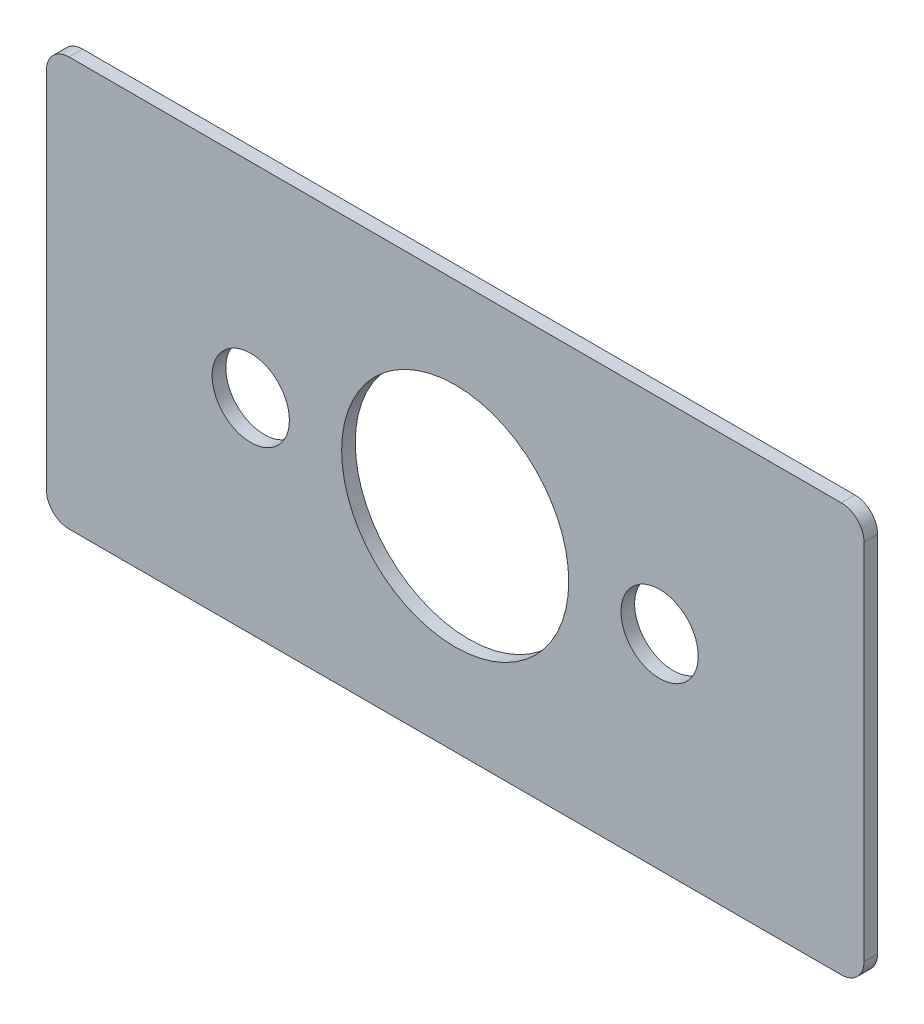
ISO-10303-21;
HEADER;
FILE_DESCRIPTION(('STEP AP214'),'2;1');
FILE_NAME('part.step','',(''),(''),'','','');
FILE_SCHEMA(('AUTOMOTIVE_DESIGN { 1 0 10303 214 1 1 1 1 }'));
ENDSEC;
DATA;
#1=APPLICATION_CONTEXT('core data for automotive mechanical design processes');
#2=APPLICATION_PROTOCOL_DEFINITION('international standard','automotive_design',2000,#1);
#3=PRODUCT_CONTEXT('',#1,'mechanical');
#4=PRODUCT('Part','Part','',(#3));
#5=PRODUCT_RELATED_PRODUCT_CATEGORY('part','',(#4));
#6=PRODUCT_DEFINITION_FORMATION('','',#4);
#7=PRODUCT_DEFINITION_CONTEXT('part definition',#1,'design');
#8=PRODUCT_DEFINITION('design','',#6,#7);
#9=PRODUCT_DEFINITION_SHAPE('','',#8);
#10=(LENGTH_UNIT() NAMED_UNIT(*) SI_UNIT(.MILLI.,.METRE.));
#11=(NAMED_UNIT(*) PLANE_ANGLE_UNIT() SI_UNIT($,.RADIAN.));
#12=(NAMED_UNIT(*) SI_UNIT($,.STERADIAN.) SOLID_ANGLE_UNIT());
#13=UNCERTAINTY_MEASURE_WITH_UNIT(LENGTH_MEASURE(1.E-05),#10,'distance_accuracy_value','');
#14=(GEOMETRIC_REPRESENTATION_CONTEXT(3) GLOBAL_UNCERTAINTY_ASSIGNED_CONTEXT((#13)) GLOBAL_UNIT_ASSIGNED_CONTEXT((#10,
#11,#12)) REPRESENTATION_CONTEXT('',''));
#15=CARTESIAN_POINT('',(0.,0.,0.));
#16=DIRECTION('',(0.,0.,1.));
#17=DIRECTION('',(1.,0.,0.));
#18=AXIS2_PLACEMENT_3D('',#15,#16,#17);
#19=CARTESIAN_POINT('',(0.,0.,0.));
#20=DIRECTION('',(0.,0.,1.));
#21=DIRECTION('',(1.,0.,0.));
#22=AXIS2_PLACEMENT_3D('',#19,#20,#21);
#23=PLANE('',#22);
#24=CARTESIAN_POINT('',(22.5,0.,0.));
#25=DIRECTION('',(0.,0.,1.));
#26=DIRECTION('',(1.,0.,0.));
#27=AXIS2_PLACEMENT_3D('',#24,#25,#26);
#28=CIRCLE('',#27,4.25);
#29=CARTESIAN_POINT('',(26.75,0.,0.));
#30=VERTEX_POINT('',#29);
#31=EDGE_CURVE('E136',#30,#30,#28,.T.);
#32=ORIENTED_EDGE('',*,*,#31,.T.);
#33=EDGE_LOOP('',(#32));
#34=FACE_BOUND('',#33,.T.);
#35=CARTESIAN_POINT('',(-22.5,0.,0.));
#36=DIRECTION('',(0.,0.,1.));
#37=DIRECTION('',(1.,0.,0.));
#38=AXIS2_PLACEMENT_3D('',#35,#36,#37);
#39=CIRCLE('',#38,4.25);
#40=CARTESIAN_POINT('',(-18.25,0.,0.));
#41=VERTEX_POINT('',#40);
#42=EDGE_CURVE('E101',#41,#41,#39,.T.);
#43=ORIENTED_EDGE('',*,*,#42,.T.);
#44=EDGE_LOOP('',(#43));
#45=FACE_BOUND('',#44,.T.);
#46=CARTESIAN_POINT('',(0.,0.,0.));
#47=DIRECTION('',(0.,0.,1.));
#48=DIRECTION('',(1.,0.,0.));
#49=AXIS2_PLACEMENT_3D('',#46,#47,#48);
#50=CIRCLE('',#49,12.5);
#51=CARTESIAN_POINT('',(12.5,0.,0.));
#52=VERTEX_POINT('',#51);
#53=EDGE_CURVE('E98',#52,#52,#50,.T.);
#54=ORIENTED_EDGE('',*,*,#53,.T.);
#55=EDGE_LOOP('',(#54));
#56=FACE_BOUND('',#55,.T.);
#57=DIRECTION('',(0.,1.,0.));
#58=VECTOR('',#57,1.);
#59=CARTESIAN_POINT('',(-45.,-22.5,0.));
#60=LINE('',#59,#58);
#61=CARTESIAN_POINT('',(-45.,20.,0.));
#62=VERTEX_POINT('',#61);
#63=CARTESIAN_POINT('',(-45.,-20.,0.));
#64=VERTEX_POINT('',#63);
#65=EDGE_CURVE('E82',#62,#64,#60,.F.);
#66=ORIENTED_EDGE('',*,*,#65,.F.);
#67=CARTESIAN_POINT('',(-42.4999999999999,20.,0.));
#68=DIRECTION('',(0.,0.,1.));
#69=DIRECTION('',(1.,0.,0.));
#70=AXIS2_PLACEMENT_3D('',#67,#68,#69);
#71=CIRCLE('',#70,2.5);
#72=CARTESIAN_POINT('',(-42.4999999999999,22.5,0.));
#73=VERTEX_POINT('',#72);
#74=EDGE_CURVE('E95',#73,#62,#71,.T.);
#75=ORIENTED_EDGE('',*,*,#74,.F.);
#76=DIRECTION('',(1.,0.,0.));
#77=VECTOR('',#76,1.);
#78=CARTESIAN_POINT('',(-44.9999999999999,22.5,0.));
#79=LINE('',#78,#77);
#80=CARTESIAN_POINT('',(42.5,22.5,0.));
#81=VERTEX_POINT('',#80);
#82=EDGE_CURVE('E107',#81,#73,#79,.F.);
#83=ORIENTED_EDGE('',*,*,#82,.F.);
#84=CARTESIAN_POINT('',(42.5,20.,0.));
#85=DIRECTION('',(0.,0.,1.));
#86=DIRECTION('',(1.,0.,0.));
#87=AXIS2_PLACEMENT_3D('',#84,#85,#86);
#88=CIRCLE('',#87,2.5);
#89=CARTESIAN_POINT('',(45.,20.,0.));
#90=VERTEX_POINT('',#89);
#91=EDGE_CURVE('E142',#90,#81,#88,.T.);
#92=ORIENTED_EDGE('',*,*,#91,.F.);
#93=DIRECTION('',(0.,1.,0.));
#94=VECTOR('',#93,1.);
#95=CARTESIAN_POINT('',(45.,22.5,0.));
#96=LINE('',#95,#94);
#97=CARTESIAN_POINT('',(45.,-20.,0.));
#98=VERTEX_POINT('',#97);
#99=EDGE_CURVE('E111',#98,#90,#96,.T.);
#100=ORIENTED_EDGE('',*,*,#99,.F.);
#101=CARTESIAN_POINT('',(42.4999999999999,-20.,0.));
#102=DIRECTION('',(0.,0.,1.));
#103=DIRECTION('',(1.,0.,0.));
#104=AXIS2_PLACEMENT_3D('',#101,#102,#103);
#105=CIRCLE('',#104,2.5);
#106=CARTESIAN_POINT('',(42.4999999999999,-22.5,0.));
#107=VERTEX_POINT('',#106);
#108=EDGE_CURVE('E143',#107,#98,#105,.T.);
#109=ORIENTED_EDGE('',*,*,#108,.F.);
#110=DIRECTION('',(1.,0.,0.));
#111=VECTOR('',#110,1.);
#112=CARTESIAN_POINT('',(44.9999999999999,-22.5,0.));
#113=LINE('',#112,#111);
#114=CARTESIAN_POINT('',(-42.5,-22.5,0.));
#115=VERTEX_POINT('',#114);
#116=EDGE_CURVE('E84',#115,#107,#113,.T.);
#117=ORIENTED_EDGE('',*,*,#116,.F.);
#118=CARTESIAN_POINT('',(-42.5,-20.,0.));
#119=DIRECTION('',(0.,0.,1.));
#120=DIRECTION('',(1.,0.,0.));
#121=AXIS2_PLACEMENT_3D('',#118,#119,#120);
#122=CIRCLE('',#121,2.5);
#123=EDGE_CURVE('E19',#64,#115,#122,.T.);
#124=ORIENTED_EDGE('',*,*,#123,.F.);
#125=EDGE_LOOP('',(#66,#75,#83,#92,#100,#109,#117,#124));
#126=FACE_BOUND('',#125,.T.);
#127=ADVANCED_FACE('F16',(#34,#45,#56,#126),#23,.F.);
#128=CARTESIAN_POINT('',(-42.5,-20.,0.));
#129=DIRECTION('',(0.,0.,1.));
#130=DIRECTION('',(1.,0.,0.));
#131=AXIS2_PLACEMENT_3D('',#128,#129,#130);
#132=CYLINDRICAL_SURFACE('',#131,2.5);
#133=ORIENTED_EDGE('',*,*,#123,.T.);
#134=DIRECTION('',(0.,0.,-1.));
#135=VECTOR('',#134,1.);
#136=CARTESIAN_POINT('',(-42.5,-22.5,0.));
#137=LINE('',#136,#135);
#138=CARTESIAN_POINT('',(-42.5,-22.5,1.5));
#139=VERTEX_POINT('',#138);
#140=EDGE_CURVE('E87',#139,#115,#137,.T.);
#141=ORIENTED_EDGE('',*,*,#140,.F.);
#142=CARTESIAN_POINT('',(-42.5,-20.,1.5));
#143=DIRECTION('',(0.,0.,1.));
#144=DIRECTION('',(1.,0.,0.));
#145=AXIS2_PLACEMENT_3D('',#142,#143,#144);
#146=CIRCLE('',#145,2.5);
#147=CARTESIAN_POINT('',(-45.,-20.,1.5));
#148=VERTEX_POINT('',#147);
#149=EDGE_CURVE('E92',#148,#139,#146,.T.);
#150=ORIENTED_EDGE('',*,*,#149,.F.);
#151=DIRECTION('',(0.,0.,1.));
#152=VECTOR('',#151,1.);
#153=CARTESIAN_POINT('',(-45.,-20.,0.));
#154=LINE('',#153,#152);
#155=EDGE_CURVE('E89',#64,#148,#154,.T.);
#156=ORIENTED_EDGE('',*,*,#155,.F.);
#157=EDGE_LOOP('',(#133,#141,#150,#156));
#158=FACE_BOUND('',#157,.T.);
#159=ADVANCED_FACE('F90',(#158),#132,.T.);
#160=CARTESIAN_POINT('',(44.9999999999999,-22.5,0.));
#161=DIRECTION('',(0.,-1.,0.));
#162=DIRECTION('',(0.,0.,-1.));
#163=AXIS2_PLACEMENT_3D('',#160,#161,#162);
#164=PLANE('',#163);
#165=DIRECTION('',(0.,0.,1.));
#166=VECTOR('',#165,1.);
#167=CARTESIAN_POINT('',(42.4999999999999,-22.5,0.));
#168=LINE('',#167,#166);
#169=CARTESIAN_POINT('',(42.4999999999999,-22.5,1.5));
#170=VERTEX_POINT('',#169);
#171=EDGE_CURVE('E115',#170,#107,#168,.F.);
#172=ORIENTED_EDGE('',*,*,#171,.F.);
#173=DIRECTION('',(1.,0.,0.));
#174=VECTOR('',#173,1.);
#175=CARTESIAN_POINT('',(0.,-22.5,1.5));
#176=LINE('',#175,#174);
#177=EDGE_CURVE('E134',#139,#170,#176,.T.);
#178=ORIENTED_EDGE('',*,*,#177,.F.);
#179=ORIENTED_EDGE('',*,*,#140,.T.);
#180=ORIENTED_EDGE('',*,*,#116,.T.);
#181=EDGE_LOOP('',(#172,#178,#179,#180));
#182=FACE_BOUND('',#181,.T.);
#183=ADVANCED_FACE('F180',(#182),#164,.T.);
#184=CARTESIAN_POINT('',(42.4999999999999,-20.,0.));
#185=DIRECTION('',(0.,0.,1.));
#186=DIRECTION('',(1.,0.,0.));
#187=AXIS2_PLACEMENT_3D('',#184,#185,#186);
#188=CYLINDRICAL_SURFACE('',#187,2.5);
#189=ORIENTED_EDGE('',*,*,#108,.T.);
#190=DIRECTION('',(0.,0.,-1.));
#191=VECTOR('',#190,1.);
#192=CARTESIAN_POINT('',(45.,-20.,0.));
#193=LINE('',#192,#191);
#194=CARTESIAN_POINT('',(45.,-20.,1.5));
#195=VERTEX_POINT('',#194);
#196=EDGE_CURVE('E114',#195,#98,#193,.T.);
#197=ORIENTED_EDGE('',*,*,#196,.F.);
#198=CARTESIAN_POINT('',(42.4999999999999,-20.,1.5));
#199=DIRECTION('',(0.,0.,1.));
#200=DIRECTION('',(1.,0.,0.));
#201=AXIS2_PLACEMENT_3D('',#198,#199,#200);
#202=CIRCLE('',#201,2.5);
#203=EDGE_CURVE('E131',#170,#195,#202,.T.);
#204=ORIENTED_EDGE('',*,*,#203,.F.);
#205=ORIENTED_EDGE('',*,*,#171,.T.);
#206=EDGE_LOOP('',(#189,#197,#204,#205));
#207=FACE_BOUND('',#206,.T.);
#208=ADVANCED_FACE('F177',(#207),#188,.T.);
#209=CARTESIAN_POINT('',(45.,22.5,0.));
#210=DIRECTION('',(1.,0.,0.));
#211=DIRECTION('',(0.,0.,-1.));
#212=AXIS2_PLACEMENT_3D('',#209,#210,#211);
#213=PLANE('',#212);
#214=ORIENTED_EDGE('',*,*,#196,.T.);
#215=ORIENTED_EDGE('',*,*,#99,.T.);
#216=DIRECTION('',(0.,0.,1.));
#217=VECTOR('',#216,1.);
#218=CARTESIAN_POINT('',(45.,20.,0.));
#219=LINE('',#218,#217);
#220=CARTESIAN_POINT('',(45.,20.,1.5));
#221=VERTEX_POINT('',#220);
#222=EDGE_CURVE('E113',#221,#90,#219,.F.);
#223=ORIENTED_EDGE('',*,*,#222,.F.);
#224=DIRECTION('',(0.,1.,0.));
#225=VECTOR('',#224,1.);
#226=CARTESIAN_POINT('',(44.9999999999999,0.,1.5));
#227=LINE('',#226,#225);
#228=EDGE_CURVE('E130',#195,#221,#227,.T.);
#229=ORIENTED_EDGE('',*,*,#228,.F.);
#230=EDGE_LOOP('',(#214,#215,#223,#229));
#231=FACE_BOUND('',#230,.T.);
#232=ADVANCED_FACE('F176',(#231),#213,.T.);
#233=CARTESIAN_POINT('',(42.5,20.,0.));
#234=DIRECTION('',(0.,0.,1.));
#235=DIRECTION('',(1.,0.,0.));
#236=AXIS2_PLACEMENT_3D('',#233,#234,#235);
#237=CYLINDRICAL_SURFACE('',#236,2.5);
#238=ORIENTED_EDGE('',*,*,#91,.T.);
#239=DIRECTION('',(0.,0.,1.));
#240=VECTOR('',#239,1.);
#241=CARTESIAN_POINT('',(42.5,22.5,0.));
#242=LINE('',#241,#240);
#243=CARTESIAN_POINT('',(42.5,22.5,1.5));
#244=VERTEX_POINT('',#243);
#245=EDGE_CURVE('E110',#244,#81,#242,.F.);
#246=ORIENTED_EDGE('',*,*,#245,.F.);
#247=CARTESIAN_POINT('',(42.5,20.,1.5));
#248=DIRECTION('',(0.,0.,1.));
#249=DIRECTION('',(1.,0.,0.));
#250=AXIS2_PLACEMENT_3D('',#247,#248,#249);
#251=CIRCLE('',#250,2.5);
#252=EDGE_CURVE('E127',#221,#244,#251,.T.);
#253=ORIENTED_EDGE('',*,*,#252,.F.);
#254=ORIENTED_EDGE('',*,*,#222,.T.);
#255=EDGE_LOOP('',(#238,#246,#253,#254));
#256=FACE_BOUND('',#255,.T.);
#257=ADVANCED_FACE('F173',(#256),#237,.T.);
#258=CARTESIAN_POINT('',(-44.9999999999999,22.5,0.));
#259=DIRECTION('',(0.,1.,0.));
#260=DIRECTION('',(0.,0.,1.));
#261=AXIS2_PLACEMENT_3D('',#258,#259,#260);
#262=PLANE('',#261);
#263=ORIENTED_EDGE('',*,*,#245,.T.);
#264=ORIENTED_EDGE('',*,*,#82,.T.);
#265=DIRECTION('',(0.,0.,1.));
#266=VECTOR('',#265,1.);
#267=CARTESIAN_POINT('',(-42.4999999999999,22.5,0.));
#268=LINE('',#267,#266);
#269=CARTESIAN_POINT('',(-42.4999999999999,22.5,1.5));
#270=VERTEX_POINT('',#269);
#271=EDGE_CURVE('E109',#270,#73,#268,.F.);
#272=ORIENTED_EDGE('',*,*,#271,.F.);
#273=DIRECTION('',(1.,0.,0.));
#274=VECTOR('',#273,1.);
#275=CARTESIAN_POINT('',(0.,22.5,1.5));
#276=LINE('',#275,#274);
#277=EDGE_CURVE('E126',#244,#270,#276,.F.);
#278=ORIENTED_EDGE('',*,*,#277,.F.);
#279=EDGE_LOOP('',(#263,#264,#272,#278));
#280=FACE_BOUND('',#279,.T.);
#281=ADVANCED_FACE('F168',(#280),#262,.T.);
#282=CARTESIAN_POINT('',(-42.4999999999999,20.,0.));
#283=DIRECTION('',(0.,0.,1.));
#284=DIRECTION('',(1.,0.,0.));
#285=AXIS2_PLACEMENT_3D('',#282,#283,#284);
#286=CYLINDRICAL_SURFACE('',#285,2.5);
#287=ORIENTED_EDGE('',*,*,#74,.T.);
#288=DIRECTION('',(0.,0.,1.));
#289=VECTOR('',#288,1.);
#290=CARTESIAN_POINT('',(-45.,20.,0.));
#291=LINE('',#290,#289);
#292=CARTESIAN_POINT('',(-45.,20.,1.5));
#293=VERTEX_POINT('',#292);
#294=EDGE_CURVE('E34',#293,#62,#291,.F.);
#295=ORIENTED_EDGE('',*,*,#294,.F.);
#296=CARTESIAN_POINT('',(-42.4999999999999,20.,1.5));
#297=DIRECTION('',(0.,0.,1.));
#298=DIRECTION('',(1.,0.,0.));
#299=AXIS2_PLACEMENT_3D('',#296,#297,#298);
#300=CIRCLE('',#299,2.5);
#301=EDGE_CURVE('E123',#270,#293,#300,.T.);
#302=ORIENTED_EDGE('',*,*,#301,.F.);
#303=ORIENTED_EDGE('',*,*,#271,.T.);
#304=EDGE_LOOP('',(#287,#295,#302,#303));
#305=FACE_BOUND('',#304,.T.);
#306=ADVANCED_FACE('F166',(#305),#286,.T.);
#307=CARTESIAN_POINT('',(-45.,-22.5,0.));
#308=DIRECTION('',(-1.,0.,0.));
#309=DIRECTION('',(0.,0.,1.));
#310=AXIS2_PLACEMENT_3D('',#307,#308,#309);
#311=PLANE('',#310);
#312=ORIENTED_EDGE('',*,*,#294,.T.);
#313=ORIENTED_EDGE('',*,*,#65,.T.);
#314=ORIENTED_EDGE('',*,*,#155,.T.);
#315=DIRECTION('',(0.,1.,0.));
#316=VECTOR('',#315,1.);
#317=CARTESIAN_POINT('',(-44.9999999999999,0.,1.5));
#318=LINE('',#317,#316);
#319=EDGE_CURVE('E122',#293,#148,#318,.F.);
#320=ORIENTED_EDGE('',*,*,#319,.F.);
#321=EDGE_LOOP('',(#312,#313,#314,#320));
#322=FACE_BOUND('',#321,.T.);
#323=ADVANCED_FACE('F97',(#322),#311,.T.);
#324=CARTESIAN_POINT('',(0.,0.,0.));
#325=DIRECTION('',(0.,0.,1.));
#326=DIRECTION('',(1.,0.,0.));
#327=AXIS2_PLACEMENT_3D('',#324,#325,#326);
#328=CYLINDRICAL_SURFACE('',#327,12.5);
#329=ORIENTED_EDGE('',*,*,#53,.F.);
#330=EDGE_LOOP('',(#329));
#331=FACE_BOUND('',#330,.T.);
#332=CARTESIAN_POINT('',(0.,0.,1.5));
#333=DIRECTION('',(0.,0.,1.));
#334=DIRECTION('',(1.,0.,0.));
#335=AXIS2_PLACEMENT_3D('',#332,#333,#334);
#336=CIRCLE('',#335,12.5);
#337=CARTESIAN_POINT('',(12.5,0.,1.5));
#338=VERTEX_POINT('',#337);
#339=EDGE_CURVE('E119',#338,#338,#336,.F.);
#340=ORIENTED_EDGE('',*,*,#339,.F.);
#341=EDGE_LOOP('',(#340));
#342=FACE_BOUND('',#341,.T.);
#343=ADVANCED_FACE('F203',(#331,#342),#328,.F.);
#344=CARTESIAN_POINT('',(-22.5,0.,0.));
#345=DIRECTION('',(0.,0.,1.));
#346=DIRECTION('',(1.,0.,0.));
#347=AXIS2_PLACEMENT_3D('',#344,#345,#346);
#348=CYLINDRICAL_SURFACE('',#347,4.25);
#349=ORIENTED_EDGE('',*,*,#42,.F.);
#350=EDGE_LOOP('',(#349));
#351=FACE_BOUND('',#350,.T.);
#352=CARTESIAN_POINT('',(-22.5,0.,1.5));
#353=DIRECTION('',(0.,0.,1.));
#354=DIRECTION('',(1.,0.,0.));
#355=AXIS2_PLACEMENT_3D('',#352,#353,#354);
#356=CIRCLE('',#355,4.25);
#357=CARTESIAN_POINT('',(-18.25,0.,1.5));
#358=VERTEX_POINT('',#357);
#359=EDGE_CURVE('E25',#358,#358,#356,.F.);
#360=ORIENTED_EDGE('',*,*,#359,.F.);
#361=EDGE_LOOP('',(#360));
#362=FACE_BOUND('',#361,.T.);
#363=ADVANCED_FACE('F196',(#351,#362),#348,.F.);
#364=CARTESIAN_POINT('',(22.5,0.,0.));
#365=DIRECTION('',(0.,0.,1.));
#366=DIRECTION('',(1.,0.,0.));
#367=AXIS2_PLACEMENT_3D('',#364,#365,#366);
#368=CYLINDRICAL_SURFACE('',#367,4.25);
#369=ORIENTED_EDGE('',*,*,#31,.F.);
#370=EDGE_LOOP('',(#369));
#371=FACE_BOUND('',#370,.T.);
#372=CARTESIAN_POINT('',(22.5,0.,1.5));
#373=DIRECTION('',(0.,0.,1.));
#374=DIRECTION('',(1.,0.,0.));
#375=AXIS2_PLACEMENT_3D('',#372,#373,#374);
#376=CIRCLE('',#375,4.25);
#377=CARTESIAN_POINT('',(26.75,0.,1.5));
#378=VERTEX_POINT('',#377);
#379=EDGE_CURVE('E11',#378,#378,#376,.F.);
#380=ORIENTED_EDGE('',*,*,#379,.F.);
#381=EDGE_LOOP('',(#380));
#382=FACE_BOUND('',#381,.T.);
#383=ADVANCED_FACE('F190',(#371,#382),#368,.F.);
#384=CARTESIAN_POINT('',(0.,0.,1.5));
#385=DIRECTION('',(0.,0.,1.));
#386=DIRECTION('',(1.,0.,0.));
#387=AXIS2_PLACEMENT_3D('',#384,#385,#386);
#388=PLANE('',#387);
#389=ORIENTED_EDGE('',*,*,#379,.T.);
#390=EDGE_LOOP('',(#389));
#391=FACE_BOUND('',#390,.T.);
#392=ORIENTED_EDGE('',*,*,#359,.T.);
#393=EDGE_LOOP('',(#392));
#394=FACE_BOUND('',#393,.T.);
#395=ORIENTED_EDGE('',*,*,#339,.T.);
#396=EDGE_LOOP('',(#395));
#397=FACE_BOUND('',#396,.T.);
#398=ORIENTED_EDGE('',*,*,#301,.T.);
#399=ORIENTED_EDGE('',*,*,#319,.T.);
#400=ORIENTED_EDGE('',*,*,#149,.T.);
#401=ORIENTED_EDGE('',*,*,#177,.T.);
#402=ORIENTED_EDGE('',*,*,#203,.T.);
#403=ORIENTED_EDGE('',*,*,#228,.T.);
#404=ORIENTED_EDGE('',*,*,#252,.T.);
#405=ORIENTED_EDGE('',*,*,#277,.T.);
#406=EDGE_LOOP('',(#398,#399,#400,#401,#402,#403,#404,#405));
#407=FACE_BOUND('',#406,.T.);
#408=ADVANCED_FACE('F164',(#391,#394,#397,#407),#388,.T.);
#409=CLOSED_SHELL('',(#127,#159,#183,#208,#232,#257,#281,#306,#323,#343,#363,#383,#408));
#410=MANIFOLD_SOLID_BREP('B1',#409);
#411=ADVANCED_BREP_SHAPE_REPRESENTATION('',(#18,#410),#14);
#412=SHAPE_DEFINITION_REPRESENTATION(#9,#411);
ENDSEC;
END-ISO-10303-21;
